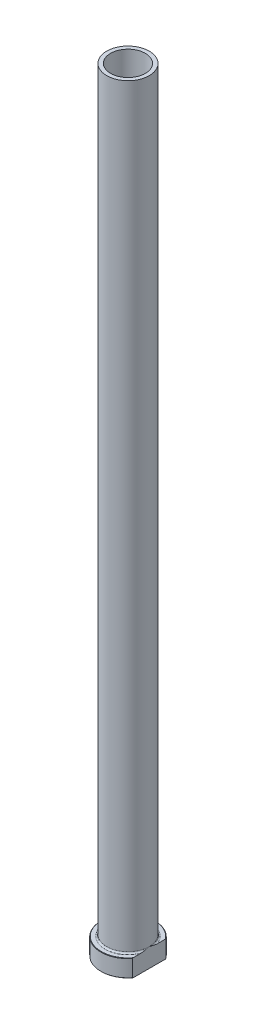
from build123d import *

# Parameters (mm, degrees)
FILLET1_R          = 0.8
CHAMFER1_SIZE      = 0.2
CUT_EXTRUDE1_DEPTH = 401.489700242
CHAMFER2_SIZE      = 0.5


with BuildPart() as part:
    # Sketch1 → Revolve1 (revolve)
    with BuildSketch(Plane.XY, mode=Mode.PRIVATE) as revolve1_sk:
        Polygon((-9, 400), (-11, 400), (-11, 9), (-14, 9), (-14, 0), (-9.25, 0), (-9.25, 333), (-9, 345), align=None)
    revolve(revolve1_sk.sketch.rotate(Axis((0, 92.187680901, 0), (0, -1, 0)), 270), axis=Axis((0, 92.187680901, 0), (0, -1, 0)))

    # Fillet1
    fillet1_edges = [part.edges().sort_by_distance(p)[0] for p in [
        (0, 9, -11),
    ]]
    fillet(fillet1_edges, radius=FILLET1_R)

    # Chamfer1
    chamfer1_edges = [part.edges().sort_by_distance(p)[0] for p in [
        (0, 0, -14),
        (0, 9, -14),
    ]]
    chamfer(chamfer1_edges, length=CHAMFER1_SIZE)

    # Sketch2 → Cut-Extrude1 (cut, through all)
    with BuildSketch(Plane.XZ):
        with BuildLine():
            Line((11, 8.660254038), (11, -8.660254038))
            ThreePointArc((11, -8.660254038), (14, 0), (11, 8.660254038))
        make_face()
    extrude(amount=-CUT_EXTRUDE1_DEPTH, mode=Mode.SUBTRACT)

    # Chamfer2
    chamfer2_edges = [part.edges().sort_by_distance(p)[0] for p in [
        (0, 0, -9.25),
    ]]
    chamfer(chamfer2_edges, length=CHAMFER2_SIZE)


solid = part.part
